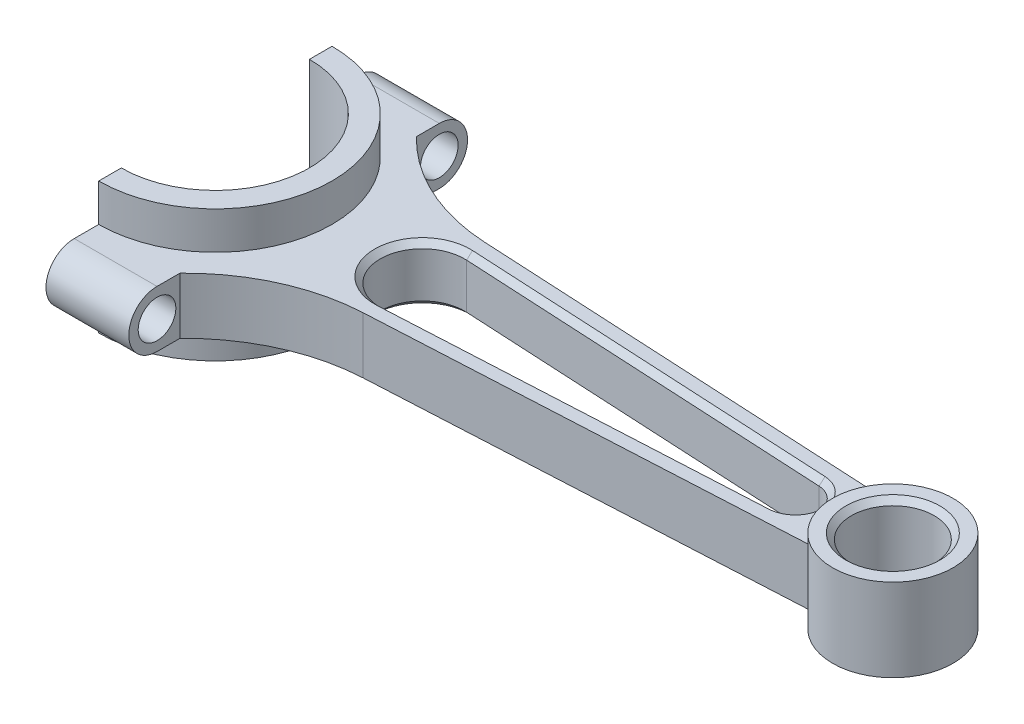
from build123d import *

# Parameters (mm, degrees)
BOSS_EXTRUDE2_DEPTH = 7.5
SKETCH1_9_R         = 15.999999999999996
SKETCH1_9_R_2       = 11.000000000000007
BOSS_EXTRUDE4_DEPTH = 11
BOSS_EXTRUDE5_DEPTH = 17.5
FILLET1_RADIUS      = 7.5
FILLET1_LENGTH      = 22
FILLET2_RADIUS      = 7.5
FILLET2_LENGTH      = 22
HOLE3_D             = 10
CHAMFER2_SIZE       = 1.5


with BuildPart() as part:
    # Sketch1 → Boss-Extrude2 (new, symmetric)
    with BuildSketch(Plane(origin=(0, 0, 0), x_dir=(1, 0, 0), z_dir=(0, 1, 0))):
        with BuildLine():
            Line((43.81360729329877, 0), (31.000000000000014, 0))
            ThreePointArc((31.000000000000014, 3.5073e-13), (21.920310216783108, -21.920310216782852), (6.9e-16, -31.000000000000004))
            Line((0, -31.000000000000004), (0, -44.999999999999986))
            Line((0, -44.999999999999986), (21.999999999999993, -44.999999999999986))
            Line((21.999999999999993, -44.999999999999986), (21.999999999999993, -31.42129685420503))
            ThreePointArc((21.999999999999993, -31.421296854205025), (37.2437089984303, -20.631799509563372), (55.383202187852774, -16.188523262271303))
            Line((55.38320218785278, -16.188523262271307), (167.75566421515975, -10.299332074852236))
            ThreePointArc((167.75566421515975, -10.299332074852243), (164.96821080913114, -5.481360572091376), (164, 1.96e-15))
            Line((164, 0), (160.0980786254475, 0))
            ThreePointArc((160.0980786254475, 8.349e-14), (158.45032485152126, -4.130127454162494), (154.41209436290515, -5.991777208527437))
            Line((154.41209436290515, -5.991777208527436), (55.58545055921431, -11.171062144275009))
            ThreePointArc((55.58545055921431, -11.171062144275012), (47.29979539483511, -8.114322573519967), (43.81360729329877, -3.5183e-13))
        make_face()
        with BuildLine():
            ThreePointArc((0, 31.000000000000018), (21.920310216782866, 21.92031021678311), (31.000000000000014, 3.5073e-13))
            Line((31.000000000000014, 0), (43.81360729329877, 0))
            ThreePointArc((43.81360729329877, -3.5183e-13), (47.299795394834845, 8.114322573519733), (55.58545055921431, 11.171062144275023))
            Line((55.58545055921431, 11.171062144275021), (154.41209436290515, 5.9917772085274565))
            ThreePointArc((154.41209436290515, 5.9917772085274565), (158.4503248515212, 4.130127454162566), (160.0980786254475, 8.21e-14))
            Line((160.0980786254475, 0), (164, 0))
            ThreePointArc((164, 1.96e-15), (164.96821080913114, 5.481360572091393), (167.75566421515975, 10.299332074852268))
            Line((167.75566421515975, 10.299332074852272), (55.38320218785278, 16.188523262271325))
            ThreePointArc((55.38320218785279, 16.188523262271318), (37.24370899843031, 20.631799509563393), (21.999999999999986, 31.42129685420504))
            Line((21.999999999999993, 31.421296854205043), (21.999999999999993, 45))
            Line((21.999999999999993, 45), (0, 45))
            Line((0, 45), (0, 31.000000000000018))
        make_face()
    extrude(amount=BOSS_EXTRUDE2_DEPTH, both=True)

    # Sketch1_9 → Boss-Extrude4 (add, symmetric)
    with BuildSketch(Plane(origin=(0, 0, 0), x_dir=(1, 0, 0), z_dir=(0, 1, 0))):
        with Locations(Location((180, 0, 0), (0, 0, 270))):
            Circle(SKETCH1_9_R)
        with Locations(Location((180, 0, 0), (0, 0, 270))):
            Circle(SKETCH1_9_R_2, mode=Mode.SUBTRACT)
    extrude(amount=BOSS_EXTRUDE4_DEPTH, both=True)

    # Sketch1_10 → Boss-Extrude5 (add, symmetric)
    with BuildSketch(Plane(origin=(0, 0, 0), x_dir=(1, 0, 0), z_dir=(0, 1, 0))):
        with BuildLine():
            ThreePointArc((0, 25.000000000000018), (17.677669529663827, 17.67766952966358), (25.000000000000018, -3.5241e-13))
            Line((25.000000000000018, 0), (31.000000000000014, 0))
            ThreePointArc((31.000000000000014, 3.5073e-13), (21.920310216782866, 21.92031021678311), (0, 31.000000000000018))
            Line((0, 31.000000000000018), (0, 25.000000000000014))
        make_face()
        with BuildLine():
            Line((31.000000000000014, 0), (25.000000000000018, 0))
            ThreePointArc((25.000000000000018, -3.5241e-13), (17.677669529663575, -17.677669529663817), (4.39e-15, -25.000000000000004))
            Line((0, -25), (0, -31.000000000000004))
            ThreePointArc((6.9e-16, -31.000000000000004), (21.920310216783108, -21.920310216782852), (31.000000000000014, 3.5073e-13))
        make_face()
    extrude(amount=BOSS_EXTRUDE5_DEPTH, both=True)

    # Fillet1: full round fillet: the end face becomes a half cylinder, R = half its width
    fillet1_face = Plane((11, 0, 45), x_dir=(1, 0, 0), z_dir=(0, 0, 1))  # on the end face: x along it, z out of the body
    fillet1_slab = fillet1_face.offset(-FILLET1_RADIUS / 2) * Box(FILLET1_LENGTH, 2 * FILLET1_RADIUS, FILLET1_RADIUS, mode=Mode.PRIVATE)  # the body's end, R deep
    fillet1_round = Plane((11, 0, 37.5), x_dir=(0, 0, 1), z_dir=(1, 0, 0)) * Cylinder(FILLET1_RADIUS, FILLET1_LENGTH, mode=Mode.PRIVATE)  # its axis R under the face
    add(fillet1_slab - fillet1_round, mode=Mode.SUBTRACT)

    # Fillet2: full round fillet: the end face becomes a half cylinder, R = half its width
    fillet2_face = Plane((11, 0, -45), x_dir=(-1, 0, 0), z_dir=(0, 0, -1))  # on the end face: x along it, z out of the body
    fillet2_slab = fillet2_face.offset(-FILLET2_RADIUS / 2) * Box(FILLET2_LENGTH, 2 * FILLET2_RADIUS, FILLET2_RADIUS, mode=Mode.PRIVATE)  # the body's end, R deep
    fillet2_round = Plane((11, 0, -37.5), x_dir=(0, 0, -1), z_dir=(-1, 0, 0)) * Cylinder(FILLET2_RADIUS, FILLET2_LENGTH, mode=Mode.PRIVATE)  # its axis R under the face
    add(fillet2_slab - fillet2_round, mode=Mode.SUBTRACT)

    # Hole3 (through all)
    with Locations(Plane(origin=(21.999999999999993, 0, 0), x_dir=(0, 0, -1), z_dir=(1, 0, 0))):
        with Locations((-37.5, 0)):
            hole3 = Hole(HOLE3_D / 2)

    # Mirror1: Hole3 across plane
    add(hole3.mirror(Plane.XY), mode=Mode.SUBTRACT)

    # Chamfer2
    chamfer2_edges = [part.edges().sort_by_distance(p)[0] for p in [
        (104.99877246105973, 7.5, -8.58141967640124),
        (160.0980786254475, 7.5, -2.703e-14),
        (104.99877246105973, 7.5, 8.581419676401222),
        (104.99877246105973, -7.5, 8.581419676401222),
        (160.0980786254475, -7.5, 5.83e-15),
        (104.99877246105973, -7.5, -8.58141967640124),
        (43.81360729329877, -7.5, -2.365e-14),
        (180, 11, -11.000000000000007),
        (180, -11, -11.000000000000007),
        (43.81360729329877, 7.5, -7.8e-16),
    ]]
    chamfer(chamfer2_edges, length=CHAMFER2_SIZE)


solid = part.part
